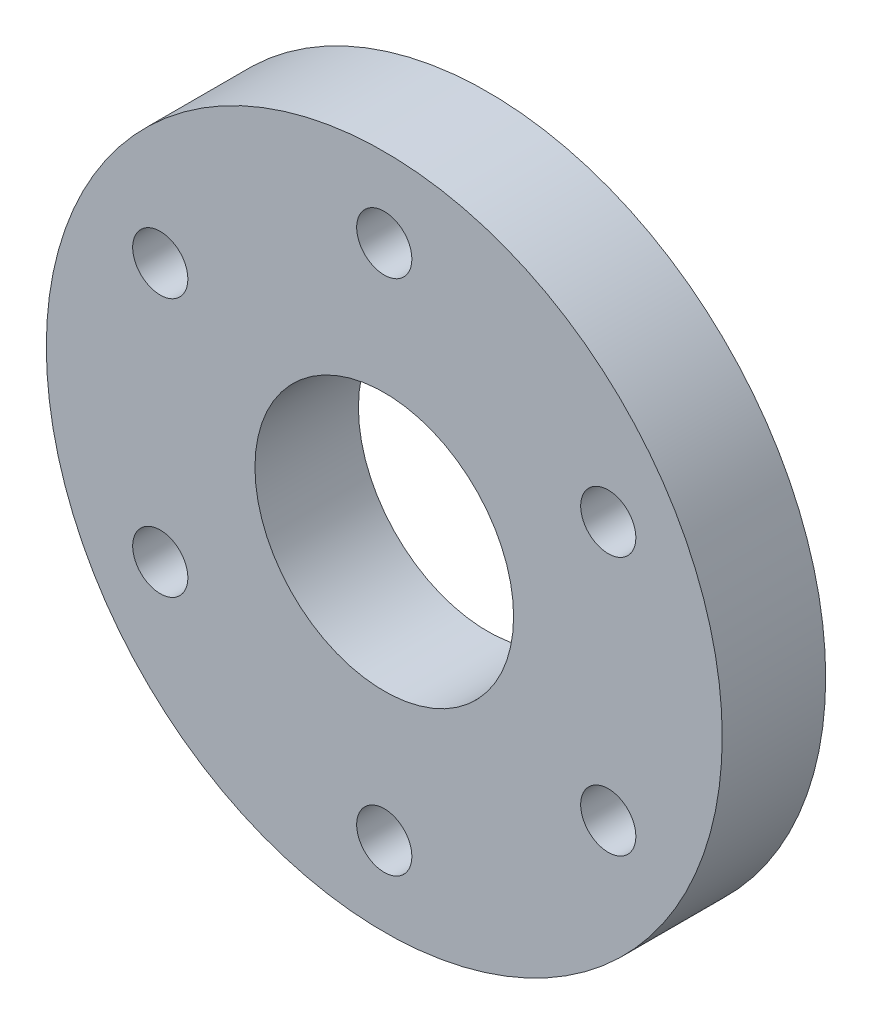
ISO-10303-21;
HEADER;
FILE_DESCRIPTION(('STEP AP214'),'2;1');
FILE_NAME('part.step','',(''),(''),'','','');
FILE_SCHEMA(('AUTOMOTIVE_DESIGN { 1 0 10303 214 1 1 1 1 }'));
ENDSEC;
DATA;
#1=APPLICATION_CONTEXT('core data for automotive mechanical design processes');
#2=APPLICATION_PROTOCOL_DEFINITION('international standard','automotive_design',2000,#1);
#3=PRODUCT_CONTEXT('',#1,'mechanical');
#4=PRODUCT('Part','Part','',(#3));
#5=PRODUCT_RELATED_PRODUCT_CATEGORY('part','',(#4));
#6=PRODUCT_DEFINITION_FORMATION('','',#4);
#7=PRODUCT_DEFINITION_CONTEXT('part definition',#1,'design');
#8=PRODUCT_DEFINITION('design','',#6,#7);
#9=PRODUCT_DEFINITION_SHAPE('','',#8);
#10=(LENGTH_UNIT() NAMED_UNIT(*) SI_UNIT(.MILLI.,.METRE.));
#11=(NAMED_UNIT(*) PLANE_ANGLE_UNIT() SI_UNIT($,.RADIAN.));
#12=(NAMED_UNIT(*) SI_UNIT($,.STERADIAN.) SOLID_ANGLE_UNIT());
#13=UNCERTAINTY_MEASURE_WITH_UNIT(LENGTH_MEASURE(1.E-05),#10,'distance_accuracy_value','');
#14=(GEOMETRIC_REPRESENTATION_CONTEXT(3) GLOBAL_UNCERTAINTY_ASSIGNED_CONTEXT((#13)) GLOBAL_UNIT_ASSIGNED_CONTEXT((#10,
#11,#12)) REPRESENTATION_CONTEXT('',''));
#15=CARTESIAN_POINT('',(0.,0.,0.));
#16=DIRECTION('',(0.,0.,1.));
#17=DIRECTION('',(1.,0.,0.));
#18=AXIS2_PLACEMENT_3D('',#15,#16,#17);
#19=CARTESIAN_POINT('',(0.,0.,7.62));
#20=DIRECTION('',(0.,0.,-1.));
#21=DIRECTION('',(-1.,0.,0.));
#22=AXIS2_PLACEMENT_3D('',#19,#20,#21);
#23=CYLINDRICAL_SURFACE('',#22,24.892);
#24=CARTESIAN_POINT('',(0.,0.,7.62));
#25=DIRECTION('',(0.,0.,1.));
#26=DIRECTION('',(1.,0.,0.));
#27=AXIS2_PLACEMENT_3D('',#24,#25,#26);
#28=CIRCLE('',#27,24.892);
#29=CARTESIAN_POINT('',(-24.892,0.,7.62));
#30=VERTEX_POINT('',#29);
#31=EDGE_CURVE('E10',#30,#30,#28,.T.);
#32=CARTESIAN_POINT('',(0.,0.,0.));
#33=DIRECTION('',(0.,0.,1.));
#34=DIRECTION('',(1.,0.,0.));
#35=AXIS2_PLACEMENT_3D('',#32,#33,#34);
#36=CIRCLE('',#35,24.892);
#37=CARTESIAN_POINT('',(-24.892,0.,0.));
#38=VERTEX_POINT('',#37);
#39=EDGE_CURVE('E40',#38,#38,#36,.T.);
#40=CARTESIAN_POINT('',(-24.892,0.,7.62));
#41=CARTESIAN_POINT('',(-24.892,0.,7.540625));
#42=CARTESIAN_POINT('',(-24.892,0.,7.46125));
#43=CARTESIAN_POINT('',(-24.892,0.,7.3025));
#44=CARTESIAN_POINT('',(-24.892,0.,7.223125));
#45=CARTESIAN_POINT('',(-24.892,0.,7.064375));
#46=CARTESIAN_POINT('',(-24.892,0.,6.985));
#47=CARTESIAN_POINT('',(-24.892,0.,6.82625));
#48=CARTESIAN_POINT('',(-24.892,0.,6.746875));
#49=CARTESIAN_POINT('',(-24.892,0.,6.588125));
#50=CARTESIAN_POINT('',(-24.892,0.,6.50875));
#51=CARTESIAN_POINT('',(-24.892,0.,6.35));
#52=CARTESIAN_POINT('',(-24.892,0.,6.270625));
#53=CARTESIAN_POINT('',(-24.892,0.,6.111875));
#54=CARTESIAN_POINT('',(-24.892,0.,6.0325));
#55=CARTESIAN_POINT('',(-24.892,0.,5.87375));
#56=CARTESIAN_POINT('',(-24.892,0.,5.794375));
#57=CARTESIAN_POINT('',(-24.892,0.,5.635625));
#58=CARTESIAN_POINT('',(-24.892,0.,5.55625));
#59=CARTESIAN_POINT('',(-24.892,0.,5.3975));
#60=CARTESIAN_POINT('',(-24.892,0.,5.318125));
#61=CARTESIAN_POINT('',(-24.892,0.,5.159375));
#62=CARTESIAN_POINT('',(-24.892,0.,5.08));
#63=CARTESIAN_POINT('',(-24.892,0.,4.92125));
#64=CARTESIAN_POINT('',(-24.892,0.,4.841875));
#65=CARTESIAN_POINT('',(-24.892,0.,4.683125));
#66=CARTESIAN_POINT('',(-24.892,0.,4.60375));
#67=CARTESIAN_POINT('',(-24.892,0.,4.445));
#68=CARTESIAN_POINT('',(-24.892,0.,4.365625));
#69=CARTESIAN_POINT('',(-24.892,0.,4.206875));
#70=CARTESIAN_POINT('',(-24.892,0.,4.1275));
#71=CARTESIAN_POINT('',(-24.892,0.,3.96875));
#72=CARTESIAN_POINT('',(-24.892,0.,3.889375));
#73=CARTESIAN_POINT('',(-24.892,0.,3.730625));
#74=CARTESIAN_POINT('',(-24.892,0.,3.65125));
#75=CARTESIAN_POINT('',(-24.892,0.,3.4925));
#76=CARTESIAN_POINT('',(-24.892,0.,3.413125));
#77=CARTESIAN_POINT('',(-24.892,0.,3.254375));
#78=CARTESIAN_POINT('',(-24.892,0.,3.175));
#79=CARTESIAN_POINT('',(-24.892,0.,3.01625));
#80=CARTESIAN_POINT('',(-24.892,0.,2.936875));
#81=CARTESIAN_POINT('',(-24.892,0.,2.778125));
#82=CARTESIAN_POINT('',(-24.892,0.,2.69875));
#83=CARTESIAN_POINT('',(-24.892,0.,2.54));
#84=CARTESIAN_POINT('',(-24.892,0.,2.460625));
#85=CARTESIAN_POINT('',(-24.892,0.,2.301875));
#86=CARTESIAN_POINT('',(-24.892,0.,2.2225));
#87=CARTESIAN_POINT('',(-24.892,0.,2.06375));
#88=CARTESIAN_POINT('',(-24.892,0.,1.984375));
#89=CARTESIAN_POINT('',(-24.892,0.,1.825625));
#90=CARTESIAN_POINT('',(-24.892,0.,1.74625));
#91=CARTESIAN_POINT('',(-24.892,0.,1.5875));
#92=CARTESIAN_POINT('',(-24.892,0.,1.508125));
#93=CARTESIAN_POINT('',(-24.892,0.,1.349375));
#94=CARTESIAN_POINT('',(-24.892,0.,1.27));
#95=CARTESIAN_POINT('',(-24.892,0.,1.11125));
#96=CARTESIAN_POINT('',(-24.892,0.,1.031875));
#97=CARTESIAN_POINT('',(-24.892,0.,0.873125));
#98=CARTESIAN_POINT('',(-24.892,0.,0.79375));
#99=CARTESIAN_POINT('',(-24.892,0.,0.635));
#100=CARTESIAN_POINT('',(-24.892,0.,0.555625));
#101=CARTESIAN_POINT('',(-24.892,0.,0.396875));
#102=CARTESIAN_POINT('',(-24.892,0.,0.3175));
#103=CARTESIAN_POINT('',(-24.892,0.,0.15875));
#104=CARTESIAN_POINT('',(-24.892,0.,0.0793749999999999));
#105=CARTESIAN_POINT('',(-24.892,0.,0.));
#106=B_SPLINE_CURVE_WITH_KNOTS('',3,(#40,#41,#42,#43,#44,#45,#46,#47,#48,#49,#50,#51,#52,#53,
#54,#55,#56,#57,#58,#59,#60,#61,#62,#63,#64,#65,#66,#67,#68,#69,#70,#71,#72,#73,#74,#75,#76,#77,
#78,#79,#80,#81,#82,#83,#84,#85,#86,#87,#88,#89,#90,#91,#92,#93,#94,#95,#96,#97,#98,#99,#100,
#101,#102,#103,#104,#105),.UNSPECIFIED.,.F.,.F.,(4,2,2,2,2,2,2,2,2,2,2,2,2,2,2,2,2,2,2,2,2,2,2,
2,2,2,2,2,2,2,2,2,4),(0.,0.238125,0.47625,0.714375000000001,0.9525,1.190625,1.42875,1.666875,
1.905,2.143125,2.38125,2.619375,2.8575,3.095625,3.33375,3.571875,3.81,4.048125,4.28625,4.524375,
4.7625,5.000625,5.23875,5.476875,5.715,5.953125,6.19125,6.429375,6.6675,6.905625,7.14375,
7.381875,7.62),.UNSPECIFIED.);
#107=EDGE_CURVE('BSEAM37',#30,#38,#106,.T.);
#108=ORIENTED_EDGE('',*,*,#31,.F.);
#109=ORIENTED_EDGE('',*,*,#39,.T.);
#110=ORIENTED_EDGE('',*,*,#107,.T.);
#111=ORIENTED_EDGE('',*,*,#107,.F.);
#112=EDGE_LOOP('',(#108,#110,#109,#111));
#113=FACE_BOUND('',#112,.T.);
#114=ADVANCED_FACE('F37',(#113),#23,.T.);
#115=CARTESIAN_POINT('',(0.,0.,7.62));
#116=DIRECTION('',(0.,0.,1.));
#117=DIRECTION('',(1.,0.,0.));
#118=AXIS2_PLACEMENT_3D('',#115,#116,#117);
#119=PLANE('',#118);
#120=CARTESIAN_POINT('',(16.4977839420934,9.52500000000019,7.62));
#121=DIRECTION('',(0.,0.,1.));
#122=DIRECTION('',(0.50000000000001,-0.866025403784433,0.));
#123=AXIS2_PLACEMENT_3D('',#120,#121,#122);
#124=CIRCLE('',#123,2.032);
#125=CARTESIAN_POINT('',(18.5297839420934,9.52500000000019,7.62));
#126=VERTEX_POINT('',#125);
#127=EDGE_CURVE('E75',#126,#126,#124,.T.);
#128=ORIENTED_EDGE('',*,*,#127,.F.);
#129=EDGE_LOOP('',(#128));
#130=FACE_BOUND('',#129,.T.);
#131=CARTESIAN_POINT('',(16.4977839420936,-9.52499999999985,7.62));
#132=DIRECTION('',(0.,0.,1.));
#133=DIRECTION('',(-0.499999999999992,-0.866025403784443,0.));
#134=AXIS2_PLACEMENT_3D('',#131,#132,#133);
#135=CIRCLE('',#134,2.032);
#136=CARTESIAN_POINT('',(18.5297839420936,-9.52499999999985,7.62));
#137=VERTEX_POINT('',#136);
#138=EDGE_CURVE('E83',#137,#137,#135,.T.);
#139=ORIENTED_EDGE('',*,*,#138,.F.);
#140=EDGE_LOOP('',(#139));
#141=FACE_BOUND('',#140,.T.);
#142=CARTESIAN_POINT('',(0.,-19.05,7.62));
#143=DIRECTION('',(0.,0.,1.));
#144=DIRECTION('',(-1.,0.,0.));
#145=AXIS2_PLACEMENT_3D('',#142,#143,#144);
#146=CIRCLE('',#145,2.032);
#147=CARTESIAN_POINT('',(2.032,-19.05,7.62));
#148=VERTEX_POINT('',#147);
#149=EDGE_CURVE('E91',#148,#148,#146,.T.);
#150=ORIENTED_EDGE('',*,*,#149,.F.);
#151=EDGE_LOOP('',(#150));
#152=FACE_BOUND('',#151,.T.);
#153=CARTESIAN_POINT('',(-16.4977839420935,-9.52500000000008,7.62));
#154=DIRECTION('',(0.,0.,1.));
#155=DIRECTION('',(-0.500000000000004,0.866025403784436,0.));
#156=AXIS2_PLACEMENT_3D('',#153,#154,#155);
#157=CIRCLE('',#156,2.032);
#158=CARTESIAN_POINT('',(-14.4657839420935,-9.52500000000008,7.62));
#159=VERTEX_POINT('',#158);
#160=EDGE_CURVE('E99',#159,#159,#157,.T.);
#161=ORIENTED_EDGE('',*,*,#160,.F.);
#162=EDGE_LOOP('',(#161));
#163=FACE_BOUND('',#162,.T.);
#164=CARTESIAN_POINT('',(-16.4977839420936,9.52499999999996,7.62));
#165=DIRECTION('',(0.,0.,1.));
#166=DIRECTION('',(0.499999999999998,0.86602540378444,0.));
#167=AXIS2_PLACEMENT_3D('',#164,#165,#166);
#168=CIRCLE('',#167,2.032);
#169=CARTESIAN_POINT('',(-14.4657839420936,9.52499999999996,7.62));
#170=VERTEX_POINT('',#169);
#171=EDGE_CURVE('E67',#170,#170,#168,.T.);
#172=ORIENTED_EDGE('',*,*,#171,.F.);
#173=EDGE_LOOP('',(#172));
#174=FACE_BOUND('',#173,.T.);
#175=CARTESIAN_POINT('',(0.,19.05,7.62));
#176=DIRECTION('',(0.,0.,1.));
#177=DIRECTION('',(1.,0.,0.));
#178=AXIS2_PLACEMENT_3D('',#175,#176,#177);
#179=CIRCLE('',#178,2.032);
#180=CARTESIAN_POINT('',(2.032,19.05,7.62));
#181=VERTEX_POINT('',#180);
#182=EDGE_CURVE('E59',#181,#181,#179,.T.);
#183=ORIENTED_EDGE('',*,*,#182,.F.);
#184=EDGE_LOOP('',(#183));
#185=FACE_BOUND('',#184,.T.);
#186=CARTESIAN_POINT('',(0.,0.,7.62));
#187=DIRECTION('',(0.,0.,1.));
#188=DIRECTION('',(1.,0.,0.));
#189=AXIS2_PLACEMENT_3D('',#186,#187,#188);
#190=CIRCLE('',#189,9.525);
#191=CARTESIAN_POINT('',(9.525,0.,7.62));
#192=VERTEX_POINT('',#191);
#193=EDGE_CURVE('E51',#192,#192,#190,.T.);
#194=ORIENTED_EDGE('',*,*,#193,.F.);
#195=EDGE_LOOP('',(#194));
#196=FACE_BOUND('',#195,.T.);
#197=ORIENTED_EDGE('',*,*,#31,.T.);
#198=EDGE_LOOP('',(#197));
#199=FACE_BOUND('',#198,.T.);
#200=ADVANCED_FACE('F118',(#130,#141,#152,#163,#174,#185,#196,#199),#119,.T.);
#201=CARTESIAN_POINT('',(0.,0.,0.));
#202=DIRECTION('',(0.,0.,1.));
#203=DIRECTION('',(1.,0.,0.));
#204=AXIS2_PLACEMENT_3D('',#201,#202,#203);
#205=PLANE('',#204);
#206=CARTESIAN_POINT('',(16.4977839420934,9.52500000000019,0.));
#207=DIRECTION('',(0.,0.,1.));
#208=DIRECTION('',(0.50000000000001,-0.866025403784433,0.));
#209=AXIS2_PLACEMENT_3D('',#206,#207,#208);
#210=CIRCLE('',#209,2.032);
#211=CARTESIAN_POINT('',(18.5297839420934,9.52500000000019,0.));
#212=VERTEX_POINT('',#211);
#213=EDGE_CURVE('E79',#212,#212,#210,.T.);
#214=ORIENTED_EDGE('',*,*,#213,.T.);
#215=EDGE_LOOP('',(#214));
#216=FACE_BOUND('',#215,.T.);
#217=CARTESIAN_POINT('',(16.4977839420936,-9.52499999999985,0.));
#218=DIRECTION('',(0.,0.,1.));
#219=DIRECTION('',(-0.499999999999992,-0.866025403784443,0.));
#220=AXIS2_PLACEMENT_3D('',#217,#218,#219);
#221=CIRCLE('',#220,2.032);
#222=CARTESIAN_POINT('',(18.5297839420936,-9.52499999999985,0.));
#223=VERTEX_POINT('',#222);
#224=EDGE_CURVE('E87',#223,#223,#221,.T.);
#225=ORIENTED_EDGE('',*,*,#224,.T.);
#226=EDGE_LOOP('',(#225));
#227=FACE_BOUND('',#226,.T.);
#228=CARTESIAN_POINT('',(0.,-19.05,0.));
#229=DIRECTION('',(0.,0.,1.));
#230=DIRECTION('',(-1.,0.,0.));
#231=AXIS2_PLACEMENT_3D('',#228,#229,#230);
#232=CIRCLE('',#231,2.032);
#233=CARTESIAN_POINT('',(2.032,-19.05,0.));
#234=VERTEX_POINT('',#233);
#235=EDGE_CURVE('E95',#234,#234,#232,.T.);
#236=ORIENTED_EDGE('',*,*,#235,.T.);
#237=EDGE_LOOP('',(#236));
#238=FACE_BOUND('',#237,.T.);
#239=CARTESIAN_POINT('',(-16.4977839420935,-9.52500000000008,0.));
#240=DIRECTION('',(0.,0.,1.));
#241=DIRECTION('',(-0.500000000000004,0.866025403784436,0.));
#242=AXIS2_PLACEMENT_3D('',#239,#240,#241);
#243=CIRCLE('',#242,2.032);
#244=CARTESIAN_POINT('',(-14.4657839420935,-9.52500000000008,0.));
#245=VERTEX_POINT('',#244);
#246=EDGE_CURVE('E71',#245,#245,#243,.T.);
#247=ORIENTED_EDGE('',*,*,#246,.T.);
#248=EDGE_LOOP('',(#247));
#249=FACE_BOUND('',#248,.T.);
#250=CARTESIAN_POINT('',(-16.4977839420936,9.52499999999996,0.));
#251=DIRECTION('',(0.,0.,1.));
#252=DIRECTION('',(0.499999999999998,0.86602540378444,0.));
#253=AXIS2_PLACEMENT_3D('',#250,#251,#252);
#254=CIRCLE('',#253,2.032);
#255=CARTESIAN_POINT('',(-14.4657839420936,9.52499999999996,0.));
#256=VERTEX_POINT('',#255);
#257=EDGE_CURVE('E63',#256,#256,#254,.T.);
#258=ORIENTED_EDGE('',*,*,#257,.T.);
#259=EDGE_LOOP('',(#258));
#260=FACE_BOUND('',#259,.T.);
#261=CARTESIAN_POINT('',(0.,19.05,0.));
#262=DIRECTION('',(0.,0.,1.));
#263=DIRECTION('',(1.,0.,0.));
#264=AXIS2_PLACEMENT_3D('',#261,#262,#263);
#265=CIRCLE('',#264,2.032);
#266=CARTESIAN_POINT('',(2.032,19.05,0.));
#267=VERTEX_POINT('',#266);
#268=EDGE_CURVE('E55',#267,#267,#265,.T.);
#269=ORIENTED_EDGE('',*,*,#268,.T.);
#270=EDGE_LOOP('',(#269));
#271=FACE_BOUND('',#270,.T.);
#272=CARTESIAN_POINT('',(0.,0.,0.));
#273=DIRECTION('',(0.,0.,1.));
#274=DIRECTION('',(1.,0.,0.));
#275=AXIS2_PLACEMENT_3D('',#272,#273,#274);
#276=CIRCLE('',#275,9.525);
#277=CARTESIAN_POINT('',(9.525,0.,0.));
#278=VERTEX_POINT('',#277);
#279=EDGE_CURVE('E49',#278,#278,#276,.T.);
#280=ORIENTED_EDGE('',*,*,#279,.T.);
#281=EDGE_LOOP('',(#280));
#282=FACE_BOUND('',#281,.T.);
#283=ORIENTED_EDGE('',*,*,#39,.F.);
#284=EDGE_LOOP('',(#283));
#285=FACE_BOUND('',#284,.T.);
#286=ADVANCED_FACE('F107',(#216,#227,#238,#249,#260,#271,#282,#285),#205,.F.);
#287=CARTESIAN_POINT('',(0.,0.,0.));
#288=DIRECTION('',(0.,0.,1.));
#289=DIRECTION('',(1.,0.,0.));
#290=AXIS2_PLACEMENT_3D('',#287,#288,#289);
#291=CYLINDRICAL_SURFACE('',#290,9.525);
#292=CARTESIAN_POINT('',(9.525,0.,0.));
#293=CARTESIAN_POINT('',(9.525,0.,0.0793749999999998));
#294=CARTESIAN_POINT('',(9.525,0.,0.15875));
#295=CARTESIAN_POINT('',(9.525,0.,0.3175));
#296=CARTESIAN_POINT('',(9.525,0.,0.396875));
#297=CARTESIAN_POINT('',(9.525,0.,0.555625));
#298=CARTESIAN_POINT('',(9.525,0.,0.635));
#299=CARTESIAN_POINT('',(9.525,0.,0.79375));
#300=CARTESIAN_POINT('',(9.525,0.,0.873125));
#301=CARTESIAN_POINT('',(9.525,0.,1.031875));
#302=CARTESIAN_POINT('',(9.525,0.,1.11125));
#303=CARTESIAN_POINT('',(9.525,0.,1.27));
#304=CARTESIAN_POINT('',(9.525,0.,1.349375));
#305=CARTESIAN_POINT('',(9.525,0.,1.508125));
#306=CARTESIAN_POINT('',(9.525,0.,1.5875));
#307=CARTESIAN_POINT('',(9.525,0.,1.74625));
#308=CARTESIAN_POINT('',(9.525,0.,1.825625));
#309=CARTESIAN_POINT('',(9.525,0.,1.984375));
#310=CARTESIAN_POINT('',(9.525,0.,2.06375));
#311=CARTESIAN_POINT('',(9.525,0.,2.2225));
#312=CARTESIAN_POINT('',(9.525,0.,2.301875));
#313=CARTESIAN_POINT('',(9.525,0.,2.460625));
#314=CARTESIAN_POINT('',(9.525,0.,2.54));
#315=CARTESIAN_POINT('',(9.525,0.,2.69875));
#316=CARTESIAN_POINT('',(9.525,0.,2.778125));
#317=CARTESIAN_POINT('',(9.525,0.,2.936875));
#318=CARTESIAN_POINT('',(9.525,0.,3.01625));
#319=CARTESIAN_POINT('',(9.525,0.,3.175));
#320=CARTESIAN_POINT('',(9.525,0.,3.254375));
#321=CARTESIAN_POINT('',(9.525,0.,3.413125));
#322=CARTESIAN_POINT('',(9.525,0.,3.4925));
#323=CARTESIAN_POINT('',(9.525,0.,3.65125));
#324=CARTESIAN_POINT('',(9.525,0.,3.730625));
#325=CARTESIAN_POINT('',(9.525,0.,3.889375));
#326=CARTESIAN_POINT('',(9.525,0.,3.96875));
#327=CARTESIAN_POINT('',(9.525,0.,4.1275));
#328=CARTESIAN_POINT('',(9.525,0.,4.206875));
#329=CARTESIAN_POINT('',(9.525,0.,4.365625));
#330=CARTESIAN_POINT('',(9.525,0.,4.445));
#331=CARTESIAN_POINT('',(9.525,0.,4.60375));
#332=CARTESIAN_POINT('',(9.525,0.,4.683125));
#333=CARTESIAN_POINT('',(9.525,0.,4.841875));
#334=CARTESIAN_POINT('',(9.525,0.,4.92125));
#335=CARTESIAN_POINT('',(9.525,0.,5.08));
#336=CARTESIAN_POINT('',(9.525,0.,5.159375));
#337=CARTESIAN_POINT('',(9.525,0.,5.318125));
#338=CARTESIAN_POINT('',(9.525,0.,5.3975));
#339=CARTESIAN_POINT('',(9.525,0.,5.55625));
#340=CARTESIAN_POINT('',(9.525,0.,5.635625));
#341=CARTESIAN_POINT('',(9.525,0.,5.794375));
#342=CARTESIAN_POINT('',(9.525,0.,5.87375));
#343=CARTESIAN_POINT('',(9.525,0.,6.0325));
#344=CARTESIAN_POINT('',(9.525,0.,6.111875));
#345=CARTESIAN_POINT('',(9.525,0.,6.270625));
#346=CARTESIAN_POINT('',(9.525,0.,6.35));
#347=CARTESIAN_POINT('',(9.525,0.,6.50875));
#348=CARTESIAN_POINT('',(9.525,0.,6.588125));
#349=CARTESIAN_POINT('',(9.525,0.,6.746875));
#350=CARTESIAN_POINT('',(9.525,0.,6.82625));
#351=CARTESIAN_POINT('',(9.525,0.,6.985));
#352=CARTESIAN_POINT('',(9.525,0.,7.064375));
#353=CARTESIAN_POINT('',(9.525,0.,7.223125));
#354=CARTESIAN_POINT('',(9.525,0.,7.3025));
#355=CARTESIAN_POINT('',(9.525,0.,7.46125));
#356=CARTESIAN_POINT('',(9.525,0.,7.540625));
#357=CARTESIAN_POINT('',(9.525,0.,7.62));
#358=B_SPLINE_CURVE_WITH_KNOTS('',3,(#292,#293,#294,#295,#296,#297,#298,#299,#300,#301,#302,
#303,#304,#305,#306,#307,#308,#309,#310,#311,#312,#313,#314,#315,#316,#317,#318,#319,#320,#321,
#322,#323,#324,#325,#326,#327,#328,#329,#330,#331,#332,#333,#334,#335,#336,#337,#338,#339,#340,
#341,#342,#343,#344,#345,#346,#347,#348,#349,#350,#351,#352,#353,#354,#355,#356,#357),
.UNSPECIFIED.,.F.,.F.,(4,2,2,2,2,2,2,2,2,2,2,2,2,2,2,2,2,2,2,2,2,2,2,2,2,2,2,2,2,2,2,2,4),(0.,
0.238125,0.47625,0.714375,0.9525,1.190625,1.42875,1.666875,1.905,2.143125,2.38125,2.619375,
2.8575,3.095625,3.33375,3.571875,3.81,4.048125,4.28625,4.524375,4.7625,5.000625,5.23875,
5.476875,5.715,5.953125,6.19125,6.429375,6.6675,6.905625,7.14375,7.381875,7.62),.UNSPECIFIED.);
#359=EDGE_CURVE('BSEAM129',#278,#192,#358,.T.);
#360=ORIENTED_EDGE('',*,*,#279,.F.);
#361=ORIENTED_EDGE('',*,*,#193,.T.);
#362=ORIENTED_EDGE('',*,*,#359,.T.);
#363=ORIENTED_EDGE('',*,*,#359,.F.);
#364=EDGE_LOOP('',(#360,#362,#361,#363));
#365=FACE_BOUND('',#364,.T.);
#366=ADVANCED_FACE('F129',(#365),#291,.F.);
#367=CARTESIAN_POINT('',(0.,19.05,0.));
#368=DIRECTION('',(0.,0.,1.));
#369=DIRECTION('',(1.,0.,0.));
#370=AXIS2_PLACEMENT_3D('',#367,#368,#369);
#371=CYLINDRICAL_SURFACE('',#370,2.032);
#372=CARTESIAN_POINT('',(2.032,19.05,0.));
#373=CARTESIAN_POINT('',(2.032,19.05,0.0793749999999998));
#374=CARTESIAN_POINT('',(2.032,19.05,0.15875));
#375=CARTESIAN_POINT('',(2.032,19.05,0.3175));
#376=CARTESIAN_POINT('',(2.032,19.05,0.396875));
#377=CARTESIAN_POINT('',(2.032,19.05,0.555625));
#378=CARTESIAN_POINT('',(2.032,19.05,0.635));
#379=CARTESIAN_POINT('',(2.032,19.05,0.79375));
#380=CARTESIAN_POINT('',(2.032,19.05,0.873125));
#381=CARTESIAN_POINT('',(2.032,19.05,1.031875));
#382=CARTESIAN_POINT('',(2.032,19.05,1.11125));
#383=CARTESIAN_POINT('',(2.032,19.05,1.27));
#384=CARTESIAN_POINT('',(2.032,19.05,1.349375));
#385=CARTESIAN_POINT('',(2.032,19.05,1.508125));
#386=CARTESIAN_POINT('',(2.032,19.05,1.5875));
#387=CARTESIAN_POINT('',(2.032,19.05,1.74625));
#388=CARTESIAN_POINT('',(2.032,19.05,1.825625));
#389=CARTESIAN_POINT('',(2.032,19.05,1.984375));
#390=CARTESIAN_POINT('',(2.032,19.05,2.06375));
#391=CARTESIAN_POINT('',(2.032,19.05,2.2225));
#392=CARTESIAN_POINT('',(2.032,19.05,2.301875));
#393=CARTESIAN_POINT('',(2.032,19.05,2.460625));
#394=CARTESIAN_POINT('',(2.032,19.05,2.54));
#395=CARTESIAN_POINT('',(2.032,19.05,2.69875));
#396=CARTESIAN_POINT('',(2.032,19.05,2.778125));
#397=CARTESIAN_POINT('',(2.032,19.05,2.936875));
#398=CARTESIAN_POINT('',(2.032,19.05,3.01625));
#399=CARTESIAN_POINT('',(2.032,19.05,3.175));
#400=CARTESIAN_POINT('',(2.032,19.05,3.254375));
#401=CARTESIAN_POINT('',(2.032,19.05,3.413125));
#402=CARTESIAN_POINT('',(2.032,19.05,3.4925));
#403=CARTESIAN_POINT('',(2.032,19.05,3.65125));
#404=CARTESIAN_POINT('',(2.032,19.05,3.730625));
#405=CARTESIAN_POINT('',(2.032,19.05,3.889375));
#406=CARTESIAN_POINT('',(2.032,19.05,3.96875));
#407=CARTESIAN_POINT('',(2.032,19.05,4.1275));
#408=CARTESIAN_POINT('',(2.032,19.05,4.206875));
#409=CARTESIAN_POINT('',(2.032,19.05,4.365625));
#410=CARTESIAN_POINT('',(2.032,19.05,4.445));
#411=CARTESIAN_POINT('',(2.032,19.05,4.60375));
#412=CARTESIAN_POINT('',(2.032,19.05,4.683125));
#413=CARTESIAN_POINT('',(2.032,19.05,4.841875));
#414=CARTESIAN_POINT('',(2.032,19.05,4.92125));
#415=CARTESIAN_POINT('',(2.032,19.05,5.08));
#416=CARTESIAN_POINT('',(2.032,19.05,5.159375));
#417=CARTESIAN_POINT('',(2.032,19.05,5.318125));
#418=CARTESIAN_POINT('',(2.032,19.05,5.3975));
#419=CARTESIAN_POINT('',(2.032,19.05,5.55625));
#420=CARTESIAN_POINT('',(2.032,19.05,5.635625));
#421=CARTESIAN_POINT('',(2.032,19.05,5.794375));
#422=CARTESIAN_POINT('',(2.032,19.05,5.87375));
#423=CARTESIAN_POINT('',(2.032,19.05,6.0325));
#424=CARTESIAN_POINT('',(2.032,19.05,6.111875));
#425=CARTESIAN_POINT('',(2.032,19.05,6.270625));
#426=CARTESIAN_POINT('',(2.032,19.05,6.35));
#427=CARTESIAN_POINT('',(2.032,19.05,6.50875));
#428=CARTESIAN_POINT('',(2.032,19.05,6.588125));
#429=CARTESIAN_POINT('',(2.032,19.05,6.746875));
#430=CARTESIAN_POINT('',(2.032,19.05,6.82625));
#431=CARTESIAN_POINT('',(2.032,19.05,6.985));
#432=CARTESIAN_POINT('',(2.032,19.05,7.064375));
#433=CARTESIAN_POINT('',(2.032,19.05,7.223125));
#434=CARTESIAN_POINT('',(2.032,19.05,7.3025));
#435=CARTESIAN_POINT('',(2.032,19.05,7.46125));
#436=CARTESIAN_POINT('',(2.032,19.05,7.540625));
#437=CARTESIAN_POINT('',(2.032,19.05,7.62));
#438=B_SPLINE_CURVE_WITH_KNOTS('',3,(#372,#373,#374,#375,#376,#377,#378,#379,#380,#381,#382,
#383,#384,#385,#386,#387,#388,#389,#390,#391,#392,#393,#394,#395,#396,#397,#398,#399,#400,#401,
#402,#403,#404,#405,#406,#407,#408,#409,#410,#411,#412,#413,#414,#415,#416,#417,#418,#419,#420,
#421,#422,#423,#424,#425,#426,#427,#428,#429,#430,#431,#432,#433,#434,#435,#436,#437),
.UNSPECIFIED.,.F.,.F.,(4,2,2,2,2,2,2,2,2,2,2,2,2,2,2,2,2,2,2,2,2,2,2,2,2,2,2,2,2,2,2,2,4),(0.,
0.238125,0.47625,0.714375,0.9525,1.190625,1.42875,1.666875,1.905,2.143125,2.38125,2.619375,
2.8575,3.095625,3.33375,3.571875,3.81,4.048125,4.28625,4.524375,4.7625,5.000625,5.23875,
5.476875,5.715,5.953125,6.19125,6.429375,6.6675,6.905625,7.14375,7.381875,7.62),.UNSPECIFIED.);
#439=EDGE_CURVE('BSEAM131',#267,#181,#438,.T.);
#440=ORIENTED_EDGE('',*,*,#268,.F.);
#441=ORIENTED_EDGE('',*,*,#182,.T.);
#442=ORIENTED_EDGE('',*,*,#439,.T.);
#443=ORIENTED_EDGE('',*,*,#439,.F.);
#444=EDGE_LOOP('',(#440,#442,#441,#443));
#445=FACE_BOUND('',#444,.T.);
#446=ADVANCED_FACE('F131',(#445),#371,.F.);
#447=CARTESIAN_POINT('',(-16.4977839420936,9.52499999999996,0.));
#448=DIRECTION('',(0.,0.,1.));
#449=DIRECTION('',(1.,0.,0.));
#450=AXIS2_PLACEMENT_3D('',#447,#448,#449);
#451=CYLINDRICAL_SURFACE('',#450,2.032);
#452=CARTESIAN_POINT('',(-14.4657839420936,9.52499999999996,0.));
#453=CARTESIAN_POINT('',(-14.4657839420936,9.52499999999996,0.0793749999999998));
#454=CARTESIAN_POINT('',(-14.4657839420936,9.52499999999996,0.15875));
#455=CARTESIAN_POINT('',(-14.4657839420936,9.52499999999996,0.3175));
#456=CARTESIAN_POINT('',(-14.4657839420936,9.52499999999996,0.396875));
#457=CARTESIAN_POINT('',(-14.4657839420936,9.52499999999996,0.555625));
#458=CARTESIAN_POINT('',(-14.4657839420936,9.52499999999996,0.635));
#459=CARTESIAN_POINT('',(-14.4657839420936,9.52499999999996,0.79375));
#460=CARTESIAN_POINT('',(-14.4657839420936,9.52499999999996,0.873125));
#461=CARTESIAN_POINT('',(-14.4657839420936,9.52499999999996,1.031875));
#462=CARTESIAN_POINT('',(-14.4657839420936,9.52499999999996,1.11125));
#463=CARTESIAN_POINT('',(-14.4657839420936,9.52499999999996,1.27));
#464=CARTESIAN_POINT('',(-14.4657839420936,9.52499999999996,1.349375));
#465=CARTESIAN_POINT('',(-14.4657839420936,9.52499999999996,1.508125));
#466=CARTESIAN_POINT('',(-14.4657839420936,9.52499999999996,1.5875));
#467=CARTESIAN_POINT('',(-14.4657839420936,9.52499999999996,1.74625));
#468=CARTESIAN_POINT('',(-14.4657839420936,9.52499999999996,1.825625));
#469=CARTESIAN_POINT('',(-14.4657839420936,9.52499999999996,1.984375));
#470=CARTESIAN_POINT('',(-14.4657839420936,9.52499999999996,2.06375));
#471=CARTESIAN_POINT('',(-14.4657839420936,9.52499999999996,2.2225));
#472=CARTESIAN_POINT('',(-14.4657839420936,9.52499999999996,2.301875));
#473=CARTESIAN_POINT('',(-14.4657839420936,9.52499999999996,2.460625));
#474=CARTESIAN_POINT('',(-14.4657839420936,9.52499999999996,2.54));
#475=CARTESIAN_POINT('',(-14.4657839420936,9.52499999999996,2.69875));
#476=CARTESIAN_POINT('',(-14.4657839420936,9.52499999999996,2.778125));
#477=CARTESIAN_POINT('',(-14.4657839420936,9.52499999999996,2.936875));
#478=CARTESIAN_POINT('',(-14.4657839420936,9.52499999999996,3.01625));
#479=CARTESIAN_POINT('',(-14.4657839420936,9.52499999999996,3.175));
#480=CARTESIAN_POINT('',(-14.4657839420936,9.52499999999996,3.254375));
#481=CARTESIAN_POINT('',(-14.4657839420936,9.52499999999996,3.413125));
#482=CARTESIAN_POINT('',(-14.4657839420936,9.52499999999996,3.4925));
#483=CARTESIAN_POINT('',(-14.4657839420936,9.52499999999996,3.65125));
#484=CARTESIAN_POINT('',(-14.4657839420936,9.52499999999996,3.730625));
#485=CARTESIAN_POINT('',(-14.4657839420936,9.52499999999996,3.889375));
#486=CARTESIAN_POINT('',(-14.4657839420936,9.52499999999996,3.96875));
#487=CARTESIAN_POINT('',(-14.4657839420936,9.52499999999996,4.1275));
#488=CARTESIAN_POINT('',(-14.4657839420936,9.52499999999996,4.206875));
#489=CARTESIAN_POINT('',(-14.4657839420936,9.52499999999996,4.365625));
#490=CARTESIAN_POINT('',(-14.4657839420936,9.52499999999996,4.445));
#491=CARTESIAN_POINT('',(-14.4657839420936,9.52499999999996,4.60375));
#492=CARTESIAN_POINT('',(-14.4657839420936,9.52499999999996,4.683125));
#493=CARTESIAN_POINT('',(-14.4657839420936,9.52499999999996,4.841875));
#494=CARTESIAN_POINT('',(-14.4657839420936,9.52499999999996,4.92125));
#495=CARTESIAN_POINT('',(-14.4657839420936,9.52499999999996,5.08));
#496=CARTESIAN_POINT('',(-14.4657839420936,9.52499999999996,5.159375));
#497=CARTESIAN_POINT('',(-14.4657839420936,9.52499999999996,5.318125));
#498=CARTESIAN_POINT('',(-14.4657839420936,9.52499999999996,5.3975));
#499=CARTESIAN_POINT('',(-14.4657839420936,9.52499999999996,5.55625));
#500=CARTESIAN_POINT('',(-14.4657839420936,9.52499999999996,5.635625));
#501=CARTESIAN_POINT('',(-14.4657839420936,9.52499999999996,5.794375));
#502=CARTESIAN_POINT('',(-14.4657839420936,9.52499999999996,5.87375));
#503=CARTESIAN_POINT('',(-14.4657839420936,9.52499999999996,6.0325));
#504=CARTESIAN_POINT('',(-14.4657839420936,9.52499999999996,6.111875));
#505=CARTESIAN_POINT('',(-14.4657839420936,9.52499999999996,6.270625));
#506=CARTESIAN_POINT('',(-14.4657839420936,9.52499999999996,6.35));
#507=CARTESIAN_POINT('',(-14.4657839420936,9.52499999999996,6.50875));
#508=CARTESIAN_POINT('',(-14.4657839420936,9.52499999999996,6.588125));
#509=CARTESIAN_POINT('',(-14.4657839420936,9.52499999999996,6.746875));
#510=CARTESIAN_POINT('',(-14.4657839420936,9.52499999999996,6.82625));
#511=CARTESIAN_POINT('',(-14.4657839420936,9.52499999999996,6.985));
#512=CARTESIAN_POINT('',(-14.4657839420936,9.52499999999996,7.064375));
#513=CARTESIAN_POINT('',(-14.4657839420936,9.52499999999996,7.223125));
#514=CARTESIAN_POINT('',(-14.4657839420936,9.52499999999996,7.3025));
#515=CARTESIAN_POINT('',(-14.4657839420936,9.52499999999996,7.46125));
#516=CARTESIAN_POINT('',(-14.4657839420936,9.52499999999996,7.540625));
#517=CARTESIAN_POINT('',(-14.4657839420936,9.52499999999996,7.62));
#518=B_SPLINE_CURVE_WITH_KNOTS('',3,(#452,#453,#454,#455,#456,#457,#458,#459,#460,#461,#462,
#463,#464,#465,#466,#467,#468,#469,#470,#471,#472,#473,#474,#475,#476,#477,#478,#479,#480,#481,
#482,#483,#484,#485,#486,#487,#488,#489,#490,#491,#492,#493,#494,#495,#496,#497,#498,#499,#500,
#501,#502,#503,#504,#505,#506,#507,#508,#509,#510,#511,#512,#513,#514,#515,#516,#517),
.UNSPECIFIED.,.F.,.F.,(4,2,2,2,2,2,2,2,2,2,2,2,2,2,2,2,2,2,2,2,2,2,2,2,2,2,2,2,2,2,2,2,4),(0.,
0.238125,0.47625,0.714375,0.9525,1.190625,1.42875,1.666875,1.905,2.143125,2.38125,2.619375,
2.8575,3.095625,3.33375,3.571875,3.81,4.048125,4.28625,4.524375,4.7625,5.000625,5.23875,
5.476875,5.715,5.953125,6.19125,6.429375,6.6675,6.905625,7.14375,7.381875,7.62),.UNSPECIFIED.);
#519=EDGE_CURVE('BSEAM114',#256,#170,#518,.T.);
#520=ORIENTED_EDGE('',*,*,#257,.F.);
#521=ORIENTED_EDGE('',*,*,#171,.T.);
#522=ORIENTED_EDGE('',*,*,#519,.T.);
#523=ORIENTED_EDGE('',*,*,#519,.F.);
#524=EDGE_LOOP('',(#520,#522,#521,#523));
#525=FACE_BOUND('',#524,.T.);
#526=ADVANCED_FACE('F114',(#525),#451,.F.);
#527=CARTESIAN_POINT('',(-16.4977839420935,-9.52500000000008,0.));
#528=DIRECTION('',(0.,0.,1.));
#529=DIRECTION('',(1.,0.,0.));
#530=AXIS2_PLACEMENT_3D('',#527,#528,#529);
#531=CYLINDRICAL_SURFACE('',#530,2.032);
#532=CARTESIAN_POINT('',(-14.4657839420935,-9.52500000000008,0.));
#533=CARTESIAN_POINT('',(-14.4657839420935,-9.52500000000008,0.0793749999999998));
#534=CARTESIAN_POINT('',(-14.4657839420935,-9.52500000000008,0.15875));
#535=CARTESIAN_POINT('',(-14.4657839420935,-9.52500000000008,0.3175));
#536=CARTESIAN_POINT('',(-14.4657839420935,-9.52500000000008,0.396875));
#537=CARTESIAN_POINT('',(-14.4657839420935,-9.52500000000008,0.555625));
#538=CARTESIAN_POINT('',(-14.4657839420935,-9.52500000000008,0.635));
#539=CARTESIAN_POINT('',(-14.4657839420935,-9.52500000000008,0.79375));
#540=CARTESIAN_POINT('',(-14.4657839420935,-9.52500000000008,0.873125));
#541=CARTESIAN_POINT('',(-14.4657839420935,-9.52500000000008,1.031875));
#542=CARTESIAN_POINT('',(-14.4657839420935,-9.52500000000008,1.11125));
#543=CARTESIAN_POINT('',(-14.4657839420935,-9.52500000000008,1.27));
#544=CARTESIAN_POINT('',(-14.4657839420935,-9.52500000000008,1.349375));
#545=CARTESIAN_POINT('',(-14.4657839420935,-9.52500000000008,1.508125));
#546=CARTESIAN_POINT('',(-14.4657839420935,-9.52500000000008,1.5875));
#547=CARTESIAN_POINT('',(-14.4657839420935,-9.52500000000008,1.74625));
#548=CARTESIAN_POINT('',(-14.4657839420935,-9.52500000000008,1.825625));
#549=CARTESIAN_POINT('',(-14.4657839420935,-9.52500000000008,1.984375));
#550=CARTESIAN_POINT('',(-14.4657839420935,-9.52500000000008,2.06375));
#551=CARTESIAN_POINT('',(-14.4657839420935,-9.52500000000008,2.2225));
#552=CARTESIAN_POINT('',(-14.4657839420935,-9.52500000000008,2.301875));
#553=CARTESIAN_POINT('',(-14.4657839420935,-9.52500000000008,2.460625));
#554=CARTESIAN_POINT('',(-14.4657839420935,-9.52500000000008,2.54));
#555=CARTESIAN_POINT('',(-14.4657839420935,-9.52500000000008,2.69875));
#556=CARTESIAN_POINT('',(-14.4657839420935,-9.52500000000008,2.778125));
#557=CARTESIAN_POINT('',(-14.4657839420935,-9.52500000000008,2.936875));
#558=CARTESIAN_POINT('',(-14.4657839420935,-9.52500000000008,3.01625));
#559=CARTESIAN_POINT('',(-14.4657839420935,-9.52500000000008,3.175));
#560=CARTESIAN_POINT('',(-14.4657839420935,-9.52500000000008,3.254375));
#561=CARTESIAN_POINT('',(-14.4657839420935,-9.52500000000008,3.413125));
#562=CARTESIAN_POINT('',(-14.4657839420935,-9.52500000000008,3.4925));
#563=CARTESIAN_POINT('',(-14.4657839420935,-9.52500000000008,3.65125));
#564=CARTESIAN_POINT('',(-14.4657839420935,-9.52500000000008,3.730625));
#565=CARTESIAN_POINT('',(-14.4657839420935,-9.52500000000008,3.889375));
#566=CARTESIAN_POINT('',(-14.4657839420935,-9.52500000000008,3.96875));
#567=CARTESIAN_POINT('',(-14.4657839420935,-9.52500000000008,4.1275));
#568=CARTESIAN_POINT('',(-14.4657839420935,-9.52500000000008,4.206875));
#569=CARTESIAN_POINT('',(-14.4657839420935,-9.52500000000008,4.365625));
#570=CARTESIAN_POINT('',(-14.4657839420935,-9.52500000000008,4.445));
#571=CARTESIAN_POINT('',(-14.4657839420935,-9.52500000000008,4.60375));
#572=CARTESIAN_POINT('',(-14.4657839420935,-9.52500000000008,4.683125));
#573=CARTESIAN_POINT('',(-14.4657839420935,-9.52500000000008,4.841875));
#574=CARTESIAN_POINT('',(-14.4657839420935,-9.52500000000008,4.92125));
#575=CARTESIAN_POINT('',(-14.4657839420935,-9.52500000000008,5.08));
#576=CARTESIAN_POINT('',(-14.4657839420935,-9.52500000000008,5.159375));
#577=CARTESIAN_POINT('',(-14.4657839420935,-9.52500000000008,5.318125));
#578=CARTESIAN_POINT('',(-14.4657839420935,-9.52500000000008,5.3975));
#579=CARTESIAN_POINT('',(-14.4657839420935,-9.52500000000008,5.55625));
#580=CARTESIAN_POINT('',(-14.4657839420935,-9.52500000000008,5.635625));
#581=CARTESIAN_POINT('',(-14.4657839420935,-9.52500000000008,5.794375));
#582=CARTESIAN_POINT('',(-14.4657839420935,-9.52500000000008,5.87375));
#583=CARTESIAN_POINT('',(-14.4657839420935,-9.52500000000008,6.0325));
#584=CARTESIAN_POINT('',(-14.4657839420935,-9.52500000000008,6.111875));
#585=CARTESIAN_POINT('',(-14.4657839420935,-9.52500000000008,6.270625));
#586=CARTESIAN_POINT('',(-14.4657839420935,-9.52500000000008,6.35));
#587=CARTESIAN_POINT('',(-14.4657839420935,-9.52500000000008,6.50875));
#588=CARTESIAN_POINT('',(-14.4657839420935,-9.52500000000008,6.588125));
#589=CARTESIAN_POINT('',(-14.4657839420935,-9.52500000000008,6.746875));
#590=CARTESIAN_POINT('',(-14.4657839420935,-9.52500000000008,6.82625));
#591=CARTESIAN_POINT('',(-14.4657839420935,-9.52500000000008,6.985));
#592=CARTESIAN_POINT('',(-14.4657839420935,-9.52500000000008,7.064375));
#593=CARTESIAN_POINT('',(-14.4657839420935,-9.52500000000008,7.223125));
#594=CARTESIAN_POINT('',(-14.4657839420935,-9.52500000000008,7.3025));
#595=CARTESIAN_POINT('',(-14.4657839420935,-9.52500000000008,7.46125));
#596=CARTESIAN_POINT('',(-14.4657839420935,-9.52500000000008,7.540625));
#597=CARTESIAN_POINT('',(-14.4657839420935,-9.52500000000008,7.62));
#598=B_SPLINE_CURVE_WITH_KNOTS('',3,(#532,#533,#534,#535,#536,#537,#538,#539,#540,#541,#542,
#543,#544,#545,#546,#547,#548,#549,#550,#551,#552,#553,#554,#555,#556,#557,#558,#559,#560,#561,
#562,#563,#564,#565,#566,#567,#568,#569,#570,#571,#572,#573,#574,#575,#576,#577,#578,#579,#580,
#581,#582,#583,#584,#585,#586,#587,#588,#589,#590,#591,#592,#593,#594,#595,#596,#597),
.UNSPECIFIED.,.F.,.F.,(4,2,2,2,2,2,2,2,2,2,2,2,2,2,2,2,2,2,2,2,2,2,2,2,2,2,2,2,2,2,2,2,4),(0.,
0.238125,0.47625,0.714375,0.9525,1.190625,1.42875,1.666875,1.905,2.143125,2.38125,2.619375,
2.8575,3.095625,3.33375,3.571875,3.81,4.048125,4.28625,4.524375,4.7625,5.000625,5.23875,
5.476875,5.715,5.953125,6.19125,6.429375,6.6675,6.905625,7.14375,7.381875,7.62),.UNSPECIFIED.);
#599=EDGE_CURVE('BSEAM110',#245,#159,#598,.T.);
#600=ORIENTED_EDGE('',*,*,#246,.F.);
#601=ORIENTED_EDGE('',*,*,#160,.T.);
#602=ORIENTED_EDGE('',*,*,#599,.T.);
#603=ORIENTED_EDGE('',*,*,#599,.F.);
#604=EDGE_LOOP('',(#600,#602,#601,#603));
#605=FACE_BOUND('',#604,.T.);
#606=ADVANCED_FACE('F110',(#605),#531,.F.);
#607=CARTESIAN_POINT('',(0.,-19.05,0.));
#608=DIRECTION('',(0.,0.,1.));
#609=DIRECTION('',(1.,0.,0.));
#610=AXIS2_PLACEMENT_3D('',#607,#608,#609);
#611=CYLINDRICAL_SURFACE('',#610,2.032);
#612=CARTESIAN_POINT('',(2.032,-19.05,0.));
#613=CARTESIAN_POINT('',(2.032,-19.05,0.0793749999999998));
#614=CARTESIAN_POINT('',(2.032,-19.05,0.15875));
#615=CARTESIAN_POINT('',(2.032,-19.05,0.3175));
#616=CARTESIAN_POINT('',(2.032,-19.05,0.396875));
#617=CARTESIAN_POINT('',(2.032,-19.05,0.555625));
#618=CARTESIAN_POINT('',(2.032,-19.05,0.635));
#619=CARTESIAN_POINT('',(2.032,-19.05,0.79375));
#620=CARTESIAN_POINT('',(2.032,-19.05,0.873125));
#621=CARTESIAN_POINT('',(2.032,-19.05,1.031875));
#622=CARTESIAN_POINT('',(2.032,-19.05,1.11125));
#623=CARTESIAN_POINT('',(2.032,-19.05,1.27));
#624=CARTESIAN_POINT('',(2.032,-19.05,1.349375));
#625=CARTESIAN_POINT('',(2.032,-19.05,1.508125));
#626=CARTESIAN_POINT('',(2.032,-19.05,1.5875));
#627=CARTESIAN_POINT('',(2.032,-19.05,1.74625));
#628=CARTESIAN_POINT('',(2.032,-19.05,1.825625));
#629=CARTESIAN_POINT('',(2.032,-19.05,1.984375));
#630=CARTESIAN_POINT('',(2.032,-19.05,2.06375));
#631=CARTESIAN_POINT('',(2.032,-19.05,2.2225));
#632=CARTESIAN_POINT('',(2.032,-19.05,2.301875));
#633=CARTESIAN_POINT('',(2.032,-19.05,2.460625));
#634=CARTESIAN_POINT('',(2.032,-19.05,2.54));
#635=CARTESIAN_POINT('',(2.032,-19.05,2.69875));
#636=CARTESIAN_POINT('',(2.032,-19.05,2.778125));
#637=CARTESIAN_POINT('',(2.032,-19.05,2.936875));
#638=CARTESIAN_POINT('',(2.032,-19.05,3.01625));
#639=CARTESIAN_POINT('',(2.032,-19.05,3.175));
#640=CARTESIAN_POINT('',(2.032,-19.05,3.254375));
#641=CARTESIAN_POINT('',(2.032,-19.05,3.413125));
#642=CARTESIAN_POINT('',(2.032,-19.05,3.4925));
#643=CARTESIAN_POINT('',(2.032,-19.05,3.65125));
#644=CARTESIAN_POINT('',(2.032,-19.05,3.730625));
#645=CARTESIAN_POINT('',(2.032,-19.05,3.889375));
#646=CARTESIAN_POINT('',(2.032,-19.05,3.96875));
#647=CARTESIAN_POINT('',(2.032,-19.05,4.1275));
#648=CARTESIAN_POINT('',(2.032,-19.05,4.206875));
#649=CARTESIAN_POINT('',(2.032,-19.05,4.365625));
#650=CARTESIAN_POINT('',(2.032,-19.05,4.445));
#651=CARTESIAN_POINT('',(2.032,-19.05,4.60375));
#652=CARTESIAN_POINT('',(2.032,-19.05,4.683125));
#653=CARTESIAN_POINT('',(2.032,-19.05,4.841875));
#654=CARTESIAN_POINT('',(2.032,-19.05,4.92125));
#655=CARTESIAN_POINT('',(2.032,-19.05,5.08));
#656=CARTESIAN_POINT('',(2.032,-19.05,5.159375));
#657=CARTESIAN_POINT('',(2.032,-19.05,5.318125));
#658=CARTESIAN_POINT('',(2.032,-19.05,5.3975));
#659=CARTESIAN_POINT('',(2.032,-19.05,5.55625));
#660=CARTESIAN_POINT('',(2.032,-19.05,5.635625));
#661=CARTESIAN_POINT('',(2.032,-19.05,5.794375));
#662=CARTESIAN_POINT('',(2.032,-19.05,5.87375));
#663=CARTESIAN_POINT('',(2.032,-19.05,6.0325));
#664=CARTESIAN_POINT('',(2.032,-19.05,6.111875));
#665=CARTESIAN_POINT('',(2.032,-19.05,6.270625));
#666=CARTESIAN_POINT('',(2.032,-19.05,6.35));
#667=CARTESIAN_POINT('',(2.032,-19.05,6.50875));
#668=CARTESIAN_POINT('',(2.032,-19.05,6.588125));
#669=CARTESIAN_POINT('',(2.032,-19.05,6.746875));
#670=CARTESIAN_POINT('',(2.032,-19.05,6.82625));
#671=CARTESIAN_POINT('',(2.032,-19.05,6.985));
#672=CARTESIAN_POINT('',(2.032,-19.05,7.064375));
#673=CARTESIAN_POINT('',(2.032,-19.05,7.223125));
#674=CARTESIAN_POINT('',(2.032,-19.05,7.3025));
#675=CARTESIAN_POINT('',(2.032,-19.05,7.46125));
#676=CARTESIAN_POINT('',(2.032,-19.05,7.540625));
#677=CARTESIAN_POINT('',(2.032,-19.05,7.62));
#678=B_SPLINE_CURVE_WITH_KNOTS('',3,(#612,#613,#614,#615,#616,#617,#618,#619,#620,#621,#622,
#623,#624,#625,#626,#627,#628,#629,#630,#631,#632,#633,#634,#635,#636,#637,#638,#639,#640,#641,
#642,#643,#644,#645,#646,#647,#648,#649,#650,#651,#652,#653,#654,#655,#656,#657,#658,#659,#660,
#661,#662,#663,#664,#665,#666,#667,#668,#669,#670,#671,#672,#673,#674,#675,#676,#677),
.UNSPECIFIED.,.F.,.F.,(4,2,2,2,2,2,2,2,2,2,2,2,2,2,2,2,2,2,2,2,2,2,2,2,2,2,2,2,2,2,2,2,4),(0.,
0.238125,0.47625,0.714375,0.9525,1.190625,1.42875,1.666875,1.905,2.143125,2.38125,2.619375,
2.8575,3.095625,3.33375,3.571875,3.81,4.048125,4.28625,4.524375,4.7625,5.000625,5.23875,
5.476875,5.715,5.953125,6.19125,6.429375,6.6675,6.905625,7.14375,7.381875,7.62),.UNSPECIFIED.);
#679=EDGE_CURVE('BSEAM113',#234,#148,#678,.T.);
#680=ORIENTED_EDGE('',*,*,#235,.F.);
#681=ORIENTED_EDGE('',*,*,#149,.T.);
#682=ORIENTED_EDGE('',*,*,#679,.T.);
#683=ORIENTED_EDGE('',*,*,#679,.F.);
#684=EDGE_LOOP('',(#680,#682,#681,#683));
#685=FACE_BOUND('',#684,.T.);
#686=ADVANCED_FACE('F113',(#685),#611,.F.);
#687=CARTESIAN_POINT('',(16.4977839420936,-9.52499999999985,0.));
#688=DIRECTION('',(0.,0.,1.));
#689=DIRECTION('',(1.,0.,0.));
#690=AXIS2_PLACEMENT_3D('',#687,#688,#689);
#691=CYLINDRICAL_SURFACE('',#690,2.032);
#692=CARTESIAN_POINT('',(18.5297839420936,-9.52499999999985,0.));
#693=CARTESIAN_POINT('',(18.5297839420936,-9.52499999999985,0.0793749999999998));
#694=CARTESIAN_POINT('',(18.5297839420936,-9.52499999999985,0.15875));
#695=CARTESIAN_POINT('',(18.5297839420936,-9.52499999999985,0.3175));
#696=CARTESIAN_POINT('',(18.5297839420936,-9.52499999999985,0.396875));
#697=CARTESIAN_POINT('',(18.5297839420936,-9.52499999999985,0.555625));
#698=CARTESIAN_POINT('',(18.5297839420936,-9.52499999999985,0.635));
#699=CARTESIAN_POINT('',(18.5297839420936,-9.52499999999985,0.79375));
#700=CARTESIAN_POINT('',(18.5297839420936,-9.52499999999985,0.873125));
#701=CARTESIAN_POINT('',(18.5297839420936,-9.52499999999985,1.031875));
#702=CARTESIAN_POINT('',(18.5297839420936,-9.52499999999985,1.11125));
#703=CARTESIAN_POINT('',(18.5297839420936,-9.52499999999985,1.27));
#704=CARTESIAN_POINT('',(18.5297839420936,-9.52499999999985,1.349375));
#705=CARTESIAN_POINT('',(18.5297839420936,-9.52499999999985,1.508125));
#706=CARTESIAN_POINT('',(18.5297839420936,-9.52499999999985,1.5875));
#707=CARTESIAN_POINT('',(18.5297839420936,-9.52499999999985,1.74625));
#708=CARTESIAN_POINT('',(18.5297839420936,-9.52499999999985,1.825625));
#709=CARTESIAN_POINT('',(18.5297839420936,-9.52499999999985,1.984375));
#710=CARTESIAN_POINT('',(18.5297839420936,-9.52499999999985,2.06375));
#711=CARTESIAN_POINT('',(18.5297839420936,-9.52499999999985,2.2225));
#712=CARTESIAN_POINT('',(18.5297839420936,-9.52499999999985,2.301875));
#713=CARTESIAN_POINT('',(18.5297839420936,-9.52499999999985,2.460625));
#714=CARTESIAN_POINT('',(18.5297839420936,-9.52499999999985,2.54));
#715=CARTESIAN_POINT('',(18.5297839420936,-9.52499999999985,2.69875));
#716=CARTESIAN_POINT('',(18.5297839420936,-9.52499999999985,2.778125));
#717=CARTESIAN_POINT('',(18.5297839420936,-9.52499999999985,2.936875));
#718=CARTESIAN_POINT('',(18.5297839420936,-9.52499999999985,3.01625));
#719=CARTESIAN_POINT('',(18.5297839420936,-9.52499999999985,3.175));
#720=CARTESIAN_POINT('',(18.5297839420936,-9.52499999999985,3.254375));
#721=CARTESIAN_POINT('',(18.5297839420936,-9.52499999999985,3.413125));
#722=CARTESIAN_POINT('',(18.5297839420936,-9.52499999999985,3.4925));
#723=CARTESIAN_POINT('',(18.5297839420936,-9.52499999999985,3.65125));
#724=CARTESIAN_POINT('',(18.5297839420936,-9.52499999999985,3.730625));
#725=CARTESIAN_POINT('',(18.5297839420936,-9.52499999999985,3.889375));
#726=CARTESIAN_POINT('',(18.5297839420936,-9.52499999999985,3.96875));
#727=CARTESIAN_POINT('',(18.5297839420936,-9.52499999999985,4.1275));
#728=CARTESIAN_POINT('',(18.5297839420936,-9.52499999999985,4.206875));
#729=CARTESIAN_POINT('',(18.5297839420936,-9.52499999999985,4.365625));
#730=CARTESIAN_POINT('',(18.5297839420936,-9.52499999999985,4.445));
#731=CARTESIAN_POINT('',(18.5297839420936,-9.52499999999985,4.60375));
#732=CARTESIAN_POINT('',(18.5297839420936,-9.52499999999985,4.683125));
#733=CARTESIAN_POINT('',(18.5297839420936,-9.52499999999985,4.841875));
#734=CARTESIAN_POINT('',(18.5297839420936,-9.52499999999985,4.92125));
#735=CARTESIAN_POINT('',(18.5297839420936,-9.52499999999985,5.08));
#736=CARTESIAN_POINT('',(18.5297839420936,-9.52499999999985,5.159375));
#737=CARTESIAN_POINT('',(18.5297839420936,-9.52499999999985,5.318125));
#738=CARTESIAN_POINT('',(18.5297839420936,-9.52499999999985,5.3975));
#739=CARTESIAN_POINT('',(18.5297839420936,-9.52499999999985,5.55625));
#740=CARTESIAN_POINT('',(18.5297839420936,-9.52499999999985,5.635625));
#741=CARTESIAN_POINT('',(18.5297839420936,-9.52499999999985,5.794375));
#742=CARTESIAN_POINT('',(18.5297839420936,-9.52499999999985,5.87375));
#743=CARTESIAN_POINT('',(18.5297839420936,-9.52499999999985,6.0325));
#744=CARTESIAN_POINT('',(18.5297839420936,-9.52499999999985,6.111875));
#745=CARTESIAN_POINT('',(18.5297839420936,-9.52499999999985,6.270625));
#746=CARTESIAN_POINT('',(18.5297839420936,-9.52499999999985,6.35));
#747=CARTESIAN_POINT('',(18.5297839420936,-9.52499999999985,6.50875));
#748=CARTESIAN_POINT('',(18.5297839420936,-9.52499999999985,6.588125));
#749=CARTESIAN_POINT('',(18.5297839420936,-9.52499999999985,6.746875));
#750=CARTESIAN_POINT('',(18.5297839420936,-9.52499999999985,6.82625));
#751=CARTESIAN_POINT('',(18.5297839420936,-9.52499999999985,6.985));
#752=CARTESIAN_POINT('',(18.5297839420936,-9.52499999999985,7.064375));
#753=CARTESIAN_POINT('',(18.5297839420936,-9.52499999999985,7.223125));
#754=CARTESIAN_POINT('',(18.5297839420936,-9.52499999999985,7.3025));
#755=CARTESIAN_POINT('',(18.5297839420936,-9.52499999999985,7.46125));
#756=CARTESIAN_POINT('',(18.5297839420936,-9.52499999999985,7.540625));
#757=CARTESIAN_POINT('',(18.5297839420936,-9.52499999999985,7.62));
#758=B_SPLINE_CURVE_WITH_KNOTS('',3,(#692,#693,#694,#695,#696,#697,#698,#699,#700,#701,#702,
#703,#704,#705,#706,#707,#708,#709,#710,#711,#712,#713,#714,#715,#716,#717,#718,#719,#720,#721,
#722,#723,#724,#725,#726,#727,#728,#729,#730,#731,#732,#733,#734,#735,#736,#737,#738,#739,#740,
#741,#742,#743,#744,#745,#746,#747,#748,#749,#750,#751,#752,#753,#754,#755,#756,#757),
.UNSPECIFIED.,.F.,.F.,(4,2,2,2,2,2,2,2,2,2,2,2,2,2,2,2,2,2,2,2,2,2,2,2,2,2,2,2,2,2,2,2,4),(0.,
0.238125,0.47625,0.714375,0.9525,1.190625,1.42875,1.666875,1.905,2.143125,2.38125,2.619375,
2.8575,3.095625,3.33375,3.571875,3.81,4.048125,4.28625,4.524375,4.7625,5.000625,5.23875,
5.476875,5.715,5.953125,6.19125,6.429375,6.6675,6.905625,7.14375,7.381875,7.62),.UNSPECIFIED.);
#759=EDGE_CURVE('BSEAM184',#223,#137,#758,.T.);
#760=ORIENTED_EDGE('',*,*,#224,.F.);
#761=ORIENTED_EDGE('',*,*,#138,.T.);
#762=ORIENTED_EDGE('',*,*,#759,.T.);
#763=ORIENTED_EDGE('',*,*,#759,.F.);
#764=EDGE_LOOP('',(#760,#762,#761,#763));
#765=FACE_BOUND('',#764,.T.);
#766=ADVANCED_FACE('F184',(#765),#691,.F.);
#767=CARTESIAN_POINT('',(16.4977839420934,9.52500000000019,0.));
#768=DIRECTION('',(0.,0.,1.));
#769=DIRECTION('',(1.,0.,0.));
#770=AXIS2_PLACEMENT_3D('',#767,#768,#769);
#771=CYLINDRICAL_SURFACE('',#770,2.032);
#772=CARTESIAN_POINT('',(18.5297839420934,9.52500000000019,0.));
#773=CARTESIAN_POINT('',(18.5297839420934,9.52500000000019,0.0793749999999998));
#774=CARTESIAN_POINT('',(18.5297839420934,9.52500000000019,0.15875));
#775=CARTESIAN_POINT('',(18.5297839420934,9.52500000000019,0.3175));
#776=CARTESIAN_POINT('',(18.5297839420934,9.52500000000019,0.396875));
#777=CARTESIAN_POINT('',(18.5297839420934,9.52500000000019,0.555625));
#778=CARTESIAN_POINT('',(18.5297839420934,9.52500000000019,0.635));
#779=CARTESIAN_POINT('',(18.5297839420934,9.52500000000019,0.79375));
#780=CARTESIAN_POINT('',(18.5297839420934,9.52500000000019,0.873125));
#781=CARTESIAN_POINT('',(18.5297839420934,9.52500000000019,1.031875));
#782=CARTESIAN_POINT('',(18.5297839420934,9.52500000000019,1.11125));
#783=CARTESIAN_POINT('',(18.5297839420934,9.52500000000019,1.27));
#784=CARTESIAN_POINT('',(18.5297839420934,9.52500000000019,1.349375));
#785=CARTESIAN_POINT('',(18.5297839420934,9.52500000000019,1.508125));
#786=CARTESIAN_POINT('',(18.5297839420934,9.52500000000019,1.5875));
#787=CARTESIAN_POINT('',(18.5297839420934,9.52500000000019,1.74625));
#788=CARTESIAN_POINT('',(18.5297839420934,9.52500000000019,1.825625));
#789=CARTESIAN_POINT('',(18.5297839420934,9.52500000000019,1.984375));
#790=CARTESIAN_POINT('',(18.5297839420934,9.52500000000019,2.06375));
#791=CARTESIAN_POINT('',(18.5297839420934,9.52500000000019,2.2225));
#792=CARTESIAN_POINT('',(18.5297839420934,9.52500000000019,2.301875));
#793=CARTESIAN_POINT('',(18.5297839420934,9.52500000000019,2.460625));
#794=CARTESIAN_POINT('',(18.5297839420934,9.52500000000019,2.54));
#795=CARTESIAN_POINT('',(18.5297839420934,9.52500000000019,2.69875));
#796=CARTESIAN_POINT('',(18.5297839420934,9.52500000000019,2.778125));
#797=CARTESIAN_POINT('',(18.5297839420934,9.52500000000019,2.936875));
#798=CARTESIAN_POINT('',(18.5297839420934,9.52500000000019,3.01625));
#799=CARTESIAN_POINT('',(18.5297839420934,9.52500000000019,3.175));
#800=CARTESIAN_POINT('',(18.5297839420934,9.52500000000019,3.254375));
#801=CARTESIAN_POINT('',(18.5297839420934,9.52500000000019,3.413125));
#802=CARTESIAN_POINT('',(18.5297839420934,9.52500000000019,3.4925));
#803=CARTESIAN_POINT('',(18.5297839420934,9.52500000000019,3.65125));
#804=CARTESIAN_POINT('',(18.5297839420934,9.52500000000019,3.730625));
#805=CARTESIAN_POINT('',(18.5297839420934,9.52500000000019,3.889375));
#806=CARTESIAN_POINT('',(18.5297839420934,9.52500000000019,3.96875));
#807=CARTESIAN_POINT('',(18.5297839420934,9.52500000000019,4.1275));
#808=CARTESIAN_POINT('',(18.5297839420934,9.52500000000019,4.206875));
#809=CARTESIAN_POINT('',(18.5297839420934,9.52500000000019,4.365625));
#810=CARTESIAN_POINT('',(18.5297839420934,9.52500000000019,4.445));
#811=CARTESIAN_POINT('',(18.5297839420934,9.52500000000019,4.60375));
#812=CARTESIAN_POINT('',(18.5297839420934,9.52500000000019,4.683125));
#813=CARTESIAN_POINT('',(18.5297839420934,9.52500000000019,4.841875));
#814=CARTESIAN_POINT('',(18.5297839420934,9.52500000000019,4.92125));
#815=CARTESIAN_POINT('',(18.5297839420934,9.52500000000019,5.08));
#816=CARTESIAN_POINT('',(18.5297839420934,9.52500000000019,5.159375));
#817=CARTESIAN_POINT('',(18.5297839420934,9.52500000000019,5.318125));
#818=CARTESIAN_POINT('',(18.5297839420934,9.52500000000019,5.3975));
#819=CARTESIAN_POINT('',(18.5297839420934,9.52500000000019,5.55625));
#820=CARTESIAN_POINT('',(18.5297839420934,9.52500000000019,5.635625));
#821=CARTESIAN_POINT('',(18.5297839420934,9.52500000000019,5.794375));
#822=CARTESIAN_POINT('',(18.5297839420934,9.52500000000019,5.87375));
#823=CARTESIAN_POINT('',(18.5297839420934,9.52500000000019,6.0325));
#824=CARTESIAN_POINT('',(18.5297839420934,9.52500000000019,6.111875));
#825=CARTESIAN_POINT('',(18.5297839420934,9.52500000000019,6.270625));
#826=CARTESIAN_POINT('',(18.5297839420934,9.52500000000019,6.35));
#827=CARTESIAN_POINT('',(18.5297839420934,9.52500000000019,6.50875));
#828=CARTESIAN_POINT('',(18.5297839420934,9.52500000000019,6.588125));
#829=CARTESIAN_POINT('',(18.5297839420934,9.52500000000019,6.746875));
#830=CARTESIAN_POINT('',(18.5297839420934,9.52500000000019,6.82625));
#831=CARTESIAN_POINT('',(18.5297839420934,9.52500000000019,6.985));
#832=CARTESIAN_POINT('',(18.5297839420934,9.52500000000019,7.064375));
#833=CARTESIAN_POINT('',(18.5297839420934,9.52500000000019,7.223125));
#834=CARTESIAN_POINT('',(18.5297839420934,9.52500000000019,7.3025));
#835=CARTESIAN_POINT('',(18.5297839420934,9.52500000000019,7.46125));
#836=CARTESIAN_POINT('',(18.5297839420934,9.52500000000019,7.540625));
#837=CARTESIAN_POINT('',(18.5297839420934,9.52500000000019,7.62));
#838=B_SPLINE_CURVE_WITH_KNOTS('',3,(#772,#773,#774,#775,#776,#777,#778,#779,#780,#781,#782,
#783,#784,#785,#786,#787,#788,#789,#790,#791,#792,#793,#794,#795,#796,#797,#798,#799,#800,#801,
#802,#803,#804,#805,#806,#807,#808,#809,#810,#811,#812,#813,#814,#815,#816,#817,#818,#819,#820,
#821,#822,#823,#824,#825,#826,#827,#828,#829,#830,#831,#832,#833,#834,#835,#836,#837),
.UNSPECIFIED.,.F.,.F.,(4,2,2,2,2,2,2,2,2,2,2,2,2,2,2,2,2,2,2,2,2,2,2,2,2,2,2,2,2,2,2,2,4),(0.,
0.238125,0.47625,0.714375,0.9525,1.190625,1.42875,1.666875,1.905,2.143125,2.38125,2.619375,
2.8575,3.095625,3.33375,3.571875,3.81,4.048125,4.28625,4.524375,4.7625,5.000625,5.23875,
5.476875,5.715,5.953125,6.19125,6.429375,6.6675,6.905625,7.14375,7.381875,7.62),.UNSPECIFIED.);
#839=EDGE_CURVE('BSEAM194',#212,#126,#838,.T.);
#840=ORIENTED_EDGE('',*,*,#213,.F.);
#841=ORIENTED_EDGE('',*,*,#127,.T.);
#842=ORIENTED_EDGE('',*,*,#839,.T.);
#843=ORIENTED_EDGE('',*,*,#839,.F.);
#844=EDGE_LOOP('',(#840,#842,#841,#843));
#845=FACE_BOUND('',#844,.T.);
#846=ADVANCED_FACE('F194',(#845),#771,.F.);
#847=CLOSED_SHELL('',(#114,#200,#286,#366,#446,#526,#606,#686,#766,#846));
#848=MANIFOLD_SOLID_BREP('B2',#847);
#849=ADVANCED_BREP_SHAPE_REPRESENTATION('',(#18,#848),#14);
#850=SHAPE_DEFINITION_REPRESENTATION(#9,#849);
ENDSEC;
END-ISO-10303-21;
